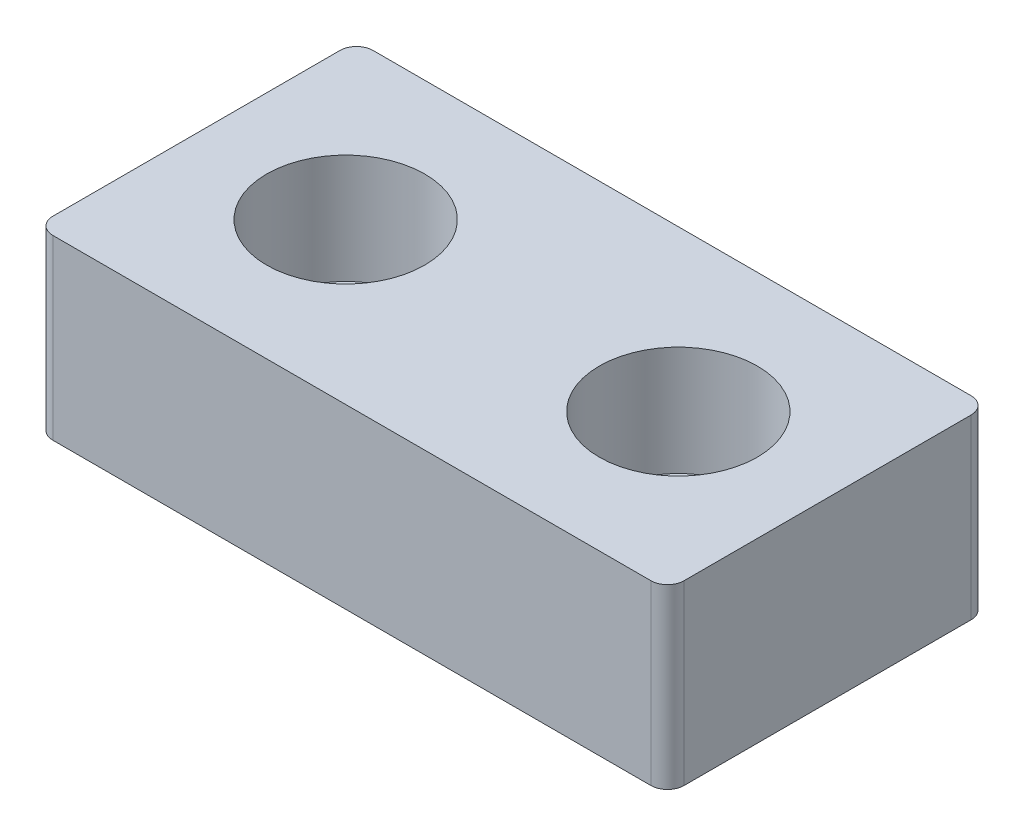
from build123d import *

# Parameters (mm, degrees)
BOSS_EXTRUDE1_START            = -1.823974
SKETCH2_W                      = 28.923118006
SKETCH2_H                      = 14.67527513
BOSS_EXTRUDE1_DEPTH            = 8.128
FILLET1_R                      = 0.762
CBORE_FOR_M4_SHCS1_D           = 4.3
CBORE_FOR_M4_SHCS1_DEPTH       = 14.986
CBORE_FOR_M4_SHCS1_CBORE_D     = 7.239
CBORE_FOR_M4_SHCS1_CBORE_DEPTH = 5.016
CBORE_FOR_M4_SHCS1_TIP         = 1.291850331


with BuildPart() as part:
    # Sketch2 → Boss-Extrude1 (new body)
    with BuildSketch(Plane(origin=(0, 0, 0), x_dir=(1, 0, 0), z_dir=(0, 1, 0)).offset(BOSS_EXTRUDE1_START)):
        with Locations((-50.184990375, 42.04319824)):
            Rectangle(SKETCH2_W, SKETCH2_H)
    extrude(amount=BOSS_EXTRUDE1_DEPTH)

    # Fillet1
    fillet1_edges = [part.edges().sort_by_distance(p)[0] for p in [
        (-64.646549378, 2.240026, -49.380835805),
        (-35.723431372, 2.240026, -49.380835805),
        (-35.723431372, 2.240026, -34.705560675),
        (-64.646549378, 2.240026, -34.705560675),
    ]]
    fillet(fillet1_edges, radius=FILLET1_R)

    # CBORE for M4 SHCS1
    with Locations(Plane(origin=(0, 6.304026, 0), x_dir=(1, 0, 0), z_dir=(0, 1, 0))):
        with Locations((-57.804990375, 42.04319824), (-42.564990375, 42.04319824)):
            CounterBoreHole(CBORE_FOR_M4_SHCS1_D / 2, CBORE_FOR_M4_SHCS1_CBORE_D / 2, CBORE_FOR_M4_SHCS1_CBORE_DEPTH, depth=CBORE_FOR_M4_SHCS1_DEPTH)
            with Locations((0, 0, -(CBORE_FOR_M4_SHCS1_DEPTH + CBORE_FOR_M4_SHCS1_TIP / 2))):  # 118° drill point
                Cone(0, CBORE_FOR_M4_SHCS1_D / 2, CBORE_FOR_M4_SHCS1_TIP, mode=Mode.SUBTRACT)


solid = part.part
